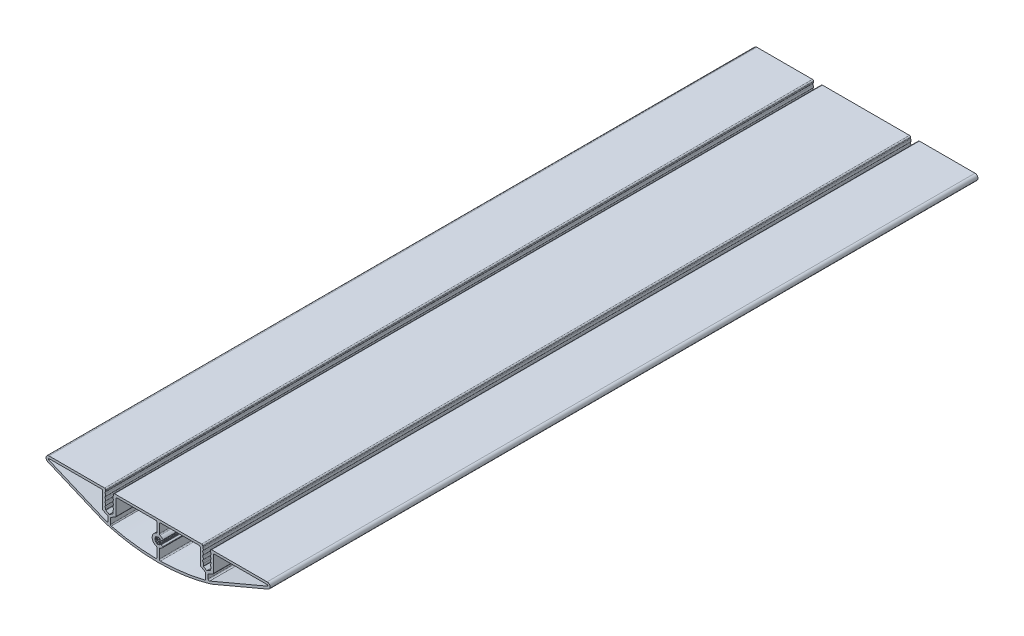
from build123d import *

# Parameters (mm, degrees)
EXTRUDE_1_DEPTH = 300


with BuildPart() as part:
    # Model → Extrude 1 (new body)
    with BuildSketch(Plane.XY):
        with BuildLine():
            Line((630.291241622, 2201.142530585), (667.16343926, 2201.142530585))
            ThreePointArc((667.16343926, 2201.142530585), (667.51699265, 2200.996083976), (667.66343926, 2200.642530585))
            Line((667.66343926, 2200.642530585), (667.66343926, 2200.282921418))
            ThreePointArc((667.66343926, 2200.282921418), (667.690229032, 2200.105636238), (667.768206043, 2199.94418249))
            ThreePointArc((667.768206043, 2199.94418249), (667.907618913, 2199.471511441), (667.743569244, 2199.0068163))
            ThreePointArc((667.743569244, 2199.0068163), (667.620324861, 2198.642530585), (667.743569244, 2198.278244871))
            ThreePointArc((667.743569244, 2198.278244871), (667.907895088, 2197.792530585), (667.743569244, 2197.3068163))
            ThreePointArc((667.743569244, 2197.3068163), (667.620324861, 2196.942530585), (667.743569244, 2196.578244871))
            ThreePointArc((667.743569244, 2196.578244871), (667.907895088, 2196.092530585), (667.743569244, 2195.6068163))
            ThreePointArc((667.743569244, 2195.6068163), (667.620324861, 2195.242530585), (667.743569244, 2194.878244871))
            ThreePointArc((667.743569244, 2194.878244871), (667.865700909, 2194.64890987), (667.907895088, 2194.392530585))
            Line((667.907895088, 2194.392530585), (667.907895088, 2193.366291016))
            ThreePointArc((667.907895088, 2193.366291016), (667.921292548, 2193.316291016), (667.957895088, 2193.279688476))
            Line((667.957895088, 2193.279688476), (669.407895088, 2192.442530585))
            Line((669.407895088, 2192.442530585), (670.807895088, 2193.250820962))
            ThreePointArc((670.807895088, 2193.250820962), (670.881100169, 2193.324026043), (670.907895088, 2193.424026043))
            Line((670.907895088, 2193.424026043), (670.907895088, 2193.542530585))
            ThreePointArc((670.907895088, 2193.542530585), (670.950089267, 2193.79890987), (671.072220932, 2194.028244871))
            ThreePointArc((671.072220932, 2194.028244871), (671.195465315, 2194.392530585), (671.072220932, 2194.7568163))
            ThreePointArc((671.072220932, 2194.7568163), (670.907895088, 2195.242530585), (671.072220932, 2195.728244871))
            ThreePointArc((671.072220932, 2195.728244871), (671.195465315, 2196.092530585), (671.072220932, 2196.4568163))
            ThreePointArc((671.072220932, 2196.4568163), (670.907895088, 2196.942530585), (671.072220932, 2197.428244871))
            ThreePointArc((671.072220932, 2197.428244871), (671.195465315, 2197.792530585), (671.072220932, 2198.1568163))
            ThreePointArc((671.072220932, 2198.1568163), (670.907895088, 2198.642530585), (671.072220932, 2199.128244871))
            ThreePointArc((671.072220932, 2199.128244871), (671.195465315, 2199.492530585), (671.072220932, 2199.8568163))
            ThreePointArc((671.072220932, 2199.8568163), (670.950089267, 2200.086151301), (670.907895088, 2200.342530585))
            Line((670.907895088, 2200.342530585), (670.907895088, 2200.642530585))
            ThreePointArc((670.907895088, 2200.642530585), (671.054341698, 2200.996083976), (671.407895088, 2201.142530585))
            Line((671.407895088, 2201.142530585), (694.955784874, 2201.142530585))
            ThreePointArc((694.955784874, 2201.142530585), (696.201884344, 2200.124134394), (695.4519673, 2198.700224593))
            Line((695.4519673, 2198.700224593), (671.907179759, 2188.721573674))
            ThreePointArc((671.907179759, 2188.721573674), (671.377313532, 2188.514581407), (670.8365344, 2188.338053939))
            ThreePointArc((670.8365344, 2188.338053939), (648.727340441, 2185.142530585), (626.618146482, 2188.338053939))
            ThreePointArc((626.618146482, 2188.338053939), (626.077367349, 2188.514581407), (625.547501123, 2188.721573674))
            Line((625.547501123, 2188.721573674), (602.002713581, 2198.700224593))
            ThreePointArc((602.002713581, 2198.700224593), (601.252796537, 2200.124134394), (602.498896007, 2201.142530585))
            Line((602.498896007, 2201.142530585), (626.046785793, 2201.142530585))
            ThreePointArc((626.046785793, 2201.142530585), (626.400339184, 2200.996083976), (626.546785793, 2200.642530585))
            Line((626.546785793, 2200.642530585), (626.546785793, 2200.342530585))
            ThreePointArc((626.546785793, 2200.342530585), (626.504591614, 2200.086151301), (626.382459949, 2199.8568163))
            ThreePointArc((626.382459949, 2199.8568163), (626.259215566, 2199.492530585), (626.382459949, 2199.128244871))
            ThreePointArc((626.382459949, 2199.128244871), (626.546785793, 2198.642530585), (626.382459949, 2198.1568163))
            ThreePointArc((626.382459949, 2198.1568163), (626.259215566, 2197.792530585), (626.382459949, 2197.428244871))
            ThreePointArc((626.382459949, 2197.428244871), (626.546785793, 2196.942530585), (626.382459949, 2196.4568163))
            ThreePointArc((626.382459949, 2196.4568163), (626.259215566, 2196.092530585), (626.382459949, 2195.728244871))
            ThreePointArc((626.382459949, 2195.728244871), (626.546785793, 2195.242530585), (626.382459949, 2194.7568163))
            ThreePointArc((626.382459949, 2194.7568163), (626.259215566, 2194.392530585), (626.382459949, 2194.028244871))
            ThreePointArc((626.382459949, 2194.028244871), (626.504591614, 2193.79890987), (626.546785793, 2193.542530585))
            Line((626.546785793, 2193.542530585), (626.546785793, 2193.424026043))
            ThreePointArc((626.546785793, 2193.424026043), (626.573580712, 2193.324026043), (626.646785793, 2193.250820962))
            Line((626.646785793, 2193.250820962), (628.046785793, 2192.442530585))
            Line((628.046785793, 2192.442530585), (629.496785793, 2193.279688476))
            ThreePointArc((629.496785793, 2193.279688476), (629.533388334, 2193.316291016), (629.546785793, 2193.366291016))
            Line((629.546785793, 2193.366291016), (629.546785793, 2194.392530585))
            ThreePointArc((629.546785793, 2194.392530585), (629.588979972, 2194.64890987), (629.711111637, 2194.878244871))
            ThreePointArc((629.711111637, 2194.878244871), (629.83435602, 2195.242530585), (629.711111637, 2195.6068163))
            ThreePointArc((629.711111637, 2195.6068163), (629.546785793, 2196.092530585), (629.711111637, 2196.578244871))
            ThreePointArc((629.711111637, 2196.578244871), (629.83435602, 2196.942530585), (629.711111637, 2197.3068163))
            ThreePointArc((629.711111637, 2197.3068163), (629.546785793, 2197.792530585), (629.711111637, 2198.278244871))
            ThreePointArc((629.711111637, 2198.278244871), (629.83435602, 2198.642530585), (629.711111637, 2199.0068163))
            ThreePointArc((629.711111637, 2199.0068163), (629.547061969, 2199.471511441), (629.686474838, 2199.94418249))
            ThreePointArc((629.686474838, 2199.94418249), (629.76445185, 2200.105636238), (629.791241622, 2200.282921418))
            Line((629.791241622, 2200.282921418), (629.791241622, 2200.642530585))
            ThreePointArc((629.791241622, 2200.642530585), (629.937688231, 2200.996083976), (630.291241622, 2201.142530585))
        make_face()
        with BuildLine():
            Line((648.227340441, 2195.97095771), (648.227340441, 2199.642530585))
            ThreePointArc((648.227340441, 2199.642530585), (648.080893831, 2199.996083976), (647.727340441, 2200.142530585))
            Line((647.727340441, 2200.142530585), (631.33435602, 2200.142530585))
            ThreePointArc((631.33435602, 2200.142530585), (630.98080263, 2199.996083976), (630.83435602, 2199.642530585))
            Line((630.83435602, 2199.642530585), (630.83435602, 2193.012704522))
            ThreePointArc((630.83435602, 2193.012704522), (630.807561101, 2192.912704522), (630.73435602, 2192.839499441))
            Line((630.73435602, 2192.839499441), (628.646785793, 2191.634240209))
            ThreePointArc((628.646785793, 2191.634240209), (628.573580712, 2191.561035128), (628.546785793, 2191.461035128))
            Line((628.546785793, 2191.461035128), (628.546785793, 2189.062927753))
            ThreePointArc((628.546785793, 2189.062927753), (628.643435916, 2188.767446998), (628.896021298, 2188.586199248))
            ThreePointArc((628.896021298, 2188.586199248), (638.237631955, 2186.833777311), (647.717725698, 2186.152238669))
            ThreePointArc((647.717725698, 2186.152238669), (648.077478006, 2186.295209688), (648.227340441, 2186.652146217))
            Line((648.227340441, 2186.652146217), (648.227340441, 2190.314103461))
            ThreePointArc((648.227340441, 2190.314103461), (648.135588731, 2190.602778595), (647.894007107, 2190.785507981))
            ThreePointArc((647.894007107, 2190.785507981), (646.227340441, 2193.142530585), (647.894007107, 2195.499553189))
            ThreePointArc((647.894007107, 2195.499553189), (648.135588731, 2195.682282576), (648.227340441, 2195.97095771))
        make_face(mode=Mode.SUBTRACT)
        with BuildLine():
            Line((650.693707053, 2191.966363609), (650.122321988, 2192.308104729))
            ThreePointArc((650.122321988, 2192.308104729), (649.972993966, 2192.330940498), (649.850291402, 2192.242824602))
            ThreePointArc((649.850291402, 2192.242824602), (649.772033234, 2192.180718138), (649.672128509, 2192.181492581))
            ThreePointArc((649.672128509, 2192.181492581), (649.491388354, 2192.153187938), (649.418311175, 2191.985474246))
            ThreePointArc((649.418311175, 2191.985474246), (649.331867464, 2191.83548452), (649.161595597, 2191.866740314))
            ThreePointArc((649.161595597, 2191.866740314), (648.98647233, 2191.919664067), (648.847864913, 2191.80026111))
            ThreePointArc((648.847864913, 2191.80026111), (648.704904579, 2191.702686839), (648.565055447, 2191.804670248))
            ThreePointArc((648.565055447, 2191.804670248), (648.430237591, 2191.92833604), (648.253549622, 2191.880897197))
            ThreePointArc((648.253549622, 2191.880897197), (648.082410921, 2191.855013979), (648.00066015, 2192.007576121))
            ThreePointArc((648.00066015, 2192.007576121), (647.932849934, 2192.177490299), (647.753076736, 2192.211411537))
            ThreePointArc((647.753076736, 2192.211411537), (647.587649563, 2192.262341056), (647.580195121, 2192.435269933))
            ThreePointArc((647.580195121, 2192.435269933), (647.592823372, 2192.617779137), (647.445571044, 2192.726341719))
            ThreePointArc((647.445571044, 2192.726341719), (647.318631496, 2192.844005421), (647.386938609, 2193.003041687))
            ThreePointArc((647.386938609, 2193.003041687), (647.477507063, 2193.161997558), (647.391937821, 2193.323699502))
            ThreePointArc((647.391937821, 2193.323699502), (647.328621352, 2193.484787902), (647.459167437, 2193.598437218))
            ThreePointArc((647.459167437, 2193.598437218), (647.609735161, 2193.702355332), (647.602799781, 2193.885170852))
            ThreePointArc((647.602799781, 2193.885170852), (647.615647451, 2194.057778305), (647.782575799, 2194.103531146))
            ThreePointArc((647.782575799, 2194.103531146), (647.963319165, 2194.131831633), (648.036393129, 2194.299549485))
            ThreePointArc((648.036393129, 2194.299549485), (648.122856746, 2194.44949617), (648.293108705, 2194.418283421))
            ThreePointArc((648.293108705, 2194.418283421), (648.468231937, 2194.365359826), (648.606839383, 2194.484762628))
            ThreePointArc((648.606839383, 2194.484762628), (648.749799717, 2194.582336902), (648.88964885, 2194.480353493))
            ThreePointArc((648.88964885, 2194.480353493), (649.024466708, 2194.356687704), (649.201154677, 2194.404126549))
            ThreePointArc((649.201154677, 2194.404126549), (649.372293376, 2194.430009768), (649.454044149, 2194.277447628))
            ThreePointArc((649.454044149, 2194.277447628), (649.521854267, 2194.107533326), (649.70162757, 2194.073612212))
            ThreePointArc((649.70162757, 2194.073612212), (649.801433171, 2194.071342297), (649.877733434, 2194.006963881))
            ThreePointArc((649.877733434, 2194.006963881), (649.99764038, 2193.915190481), (650.147523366, 2193.93349686))
            Line((650.147523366, 2193.93349686), (650.729098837, 2194.257419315))
            ThreePointArc((650.729098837, 2194.257419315), (650.826344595, 2194.385831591), (650.797384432, 2194.544285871))
            ThreePointArc((650.797384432, 2194.544285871), (650.255537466, 2195.120968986), (649.560673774, 2195.49955319))
            ThreePointArc((649.560673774, 2195.49955319), (649.31909215, 2195.682282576), (649.22734044, 2195.970957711))
            Line((649.22734044, 2195.970957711), (649.22734044, 2199.642530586))
            ThreePointArc((649.22734044, 2199.642530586), (649.37378705, 2199.996083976), (649.72734044, 2200.142530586))
            Line((649.72734044, 2200.142530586), (666.120324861, 2200.142530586))
            ThreePointArc((666.120324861, 2200.142530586), (666.473878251, 2199.996083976), (666.620324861, 2199.642530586))
            Line((666.620324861, 2199.642530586), (666.620324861, 2193.012704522))
            ThreePointArc((666.620324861, 2193.012704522), (666.64711978, 2192.912704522), (666.720324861, 2192.839499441))
            Line((666.720324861, 2192.839499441), (668.807895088, 2191.634240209))
            ThreePointArc((668.807895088, 2191.634240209), (668.881100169, 2191.561035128), (668.907895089, 2191.461035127))
            Line((668.907895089, 2191.461035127), (668.907895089, 2189.062927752))
            ThreePointArc((668.907895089, 2189.062927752), (668.811244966, 2188.767446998), (668.558659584, 2188.586199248))
            ThreePointArc((668.558659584, 2188.586199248), (659.217048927, 2186.83377731), (649.736955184, 2186.152238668))
            ThreePointArc((649.736955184, 2186.152238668), (649.377202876, 2186.295209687), (649.227340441, 2186.652146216))
            Line((649.227340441, 2186.652146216), (649.227340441, 2190.31410346))
            ThreePointArc((649.227340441, 2190.31410346), (649.319092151, 2190.602778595), (649.560673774, 2190.785507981))
            ThreePointArc((649.560673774, 2190.785507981), (650.22485142, 2191.140666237), (650.753110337, 2191.677519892))
            ThreePointArc((650.753110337, 2191.677519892), (650.786948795, 2191.835009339), (650.693707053, 2191.966363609))
        make_face(mode=Mode.SUBTRACT)
        with BuildLine():
            Line((694.955784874, 2200.142530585), (672.695465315, 2200.142530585))
            ThreePointArc((672.695465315, 2200.142530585), (672.341911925, 2199.996083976), (672.195465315, 2199.642530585))
            Line((672.195465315, 2199.642530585), (672.195465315, 2192.853918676))
            ThreePointArc((672.195465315, 2192.853918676), (672.148760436, 2192.693165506), (672.023188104, 2192.582465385))
            Line((672.023188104, 2192.582465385), (670.007895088, 2191.634240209))
            ThreePointArc((670.007895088, 2191.634240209), (669.934690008, 2191.561035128), (669.907895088, 2191.461035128))
            Line((669.907895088, 2191.461035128), (669.907895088, 2189.715307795))
            ThreePointArc((669.907895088, 2189.715307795), (670.131810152, 2189.298441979), (670.603003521, 2189.254946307))
            Line((670.603003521, 2189.254946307), (695.061750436, 2199.620947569))
            ThreePointArc((695.061750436, 2199.620947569), (695.221903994, 2199.925040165), (694.955784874, 2200.142530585))
        make_face(mode=Mode.SUBTRACT)
        with BuildLine():
            Line((627.446785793, 2191.634240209), (625.431492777, 2192.582465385))
            ThreePointArc((625.431492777, 2192.582465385), (625.305920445, 2192.693165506), (625.259215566, 2192.853918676))
            Line((625.259215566, 2192.853918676), (625.259215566, 2199.642530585))
            ThreePointArc((625.259215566, 2199.642530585), (625.112768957, 2199.996083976), (624.759215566, 2200.142530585))
            Line((624.759215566, 2200.142530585), (602.498896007, 2200.142530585))
            ThreePointArc((602.498896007, 2200.142530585), (602.232776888, 2199.925040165), (602.392930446, 2199.620947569))
            Line((602.392930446, 2199.620947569), (626.851677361, 2189.254946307))
            ThreePointArc((626.851677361, 2189.254946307), (627.322870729, 2189.298441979), (627.546785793, 2189.715307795))
            Line((627.546785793, 2189.715307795), (627.546785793, 2191.461035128))
            ThreePointArc((627.546785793, 2191.461035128), (627.519990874, 2191.561035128), (627.446785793, 2191.634240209))
        make_face(mode=Mode.SUBTRACT)
    extrude(amount=EXTRUDE_1_DEPTH)


solid = part.part
